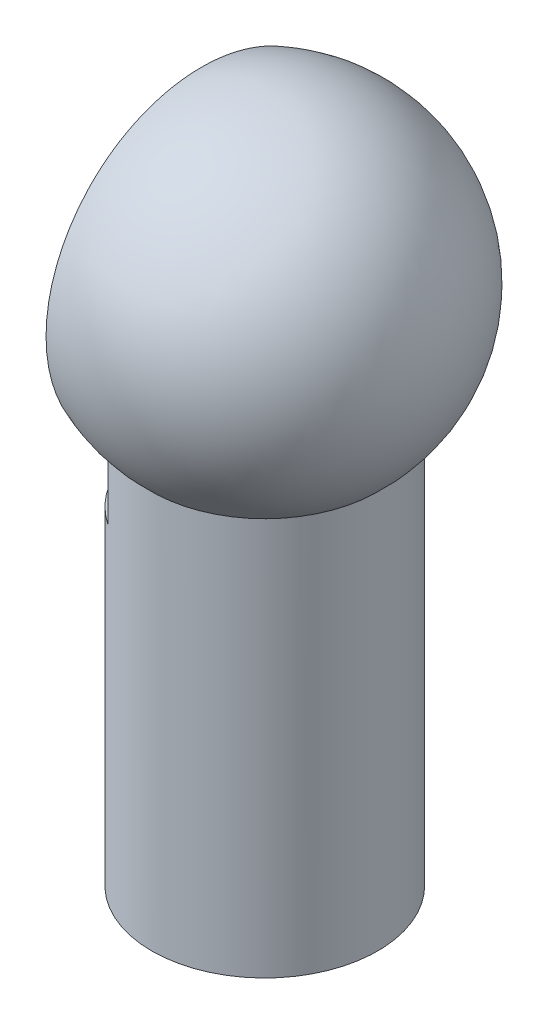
ISO-10303-21;
HEADER;
FILE_DESCRIPTION(('STEP AP214'),'2;1');
FILE_NAME('part.step','',(''),(''),'','','');
FILE_SCHEMA(('AUTOMOTIVE_DESIGN { 1 0 10303 214 1 1 1 1 }'));
ENDSEC;
DATA;
#1=APPLICATION_CONTEXT('core data for automotive mechanical design processes');
#2=APPLICATION_PROTOCOL_DEFINITION('international standard','automotive_design',2000,#1);
#3=PRODUCT_CONTEXT('',#1,'mechanical');
#4=PRODUCT('Part','Part','',(#3));
#5=PRODUCT_RELATED_PRODUCT_CATEGORY('part','',(#4));
#6=PRODUCT_DEFINITION_FORMATION('','',#4);
#7=PRODUCT_DEFINITION_CONTEXT('part definition',#1,'design');
#8=PRODUCT_DEFINITION('design','',#6,#7);
#9=PRODUCT_DEFINITION_SHAPE('','',#8);
#10=(LENGTH_UNIT() NAMED_UNIT(*) SI_UNIT(.MILLI.,.METRE.));
#11=(NAMED_UNIT(*) PLANE_ANGLE_UNIT() SI_UNIT($,.RADIAN.));
#12=(NAMED_UNIT(*) SI_UNIT($,.STERADIAN.) SOLID_ANGLE_UNIT());
#13=UNCERTAINTY_MEASURE_WITH_UNIT(LENGTH_MEASURE(1.E-05),#10,'distance_accuracy_value','');
#14=(GEOMETRIC_REPRESENTATION_CONTEXT(3) GLOBAL_UNCERTAINTY_ASSIGNED_CONTEXT((#13)) GLOBAL_UNIT_ASSIGNED_CONTEXT((#10,
#11,#12)) REPRESENTATION_CONTEXT('',''));
#15=CARTESIAN_POINT('',(0.,0.,0.));
#16=DIRECTION('',(0.,0.,1.));
#17=DIRECTION('',(1.,0.,0.));
#18=AXIS2_PLACEMENT_3D('',#15,#16,#17);
#19=CARTESIAN_POINT('',(0.,0.,0.));
#20=DIRECTION('',(0.,-1.,0.));
#21=DIRECTION('',(-1.,0.,0.));
#22=AXIS2_PLACEMENT_3D('',#19,#20,#21);
#23=SPHERICAL_SURFACE('',#22,9.65);
#24=CARTESIAN_POINT('',(0.,-7.13249605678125,0.));
#25=DIRECTION('',(0.,-1.,0.));
#26=DIRECTION('',(0.,0.,-1.));
#27=AXIS2_PLACEMENT_3D('',#24,#25,#26);
#28=CIRCLE('',#27,6.5);
#29=CARTESIAN_POINT('',(-3.63664667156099,-7.13249605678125,-5.38746702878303));
#30=VERTEX_POINT('',#29);
#31=CARTESIAN_POINT('',(-3.63664667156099,-7.13249605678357,5.38746702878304));
#32=VERTEX_POINT('',#31);
#33=EDGE_CURVE('E79',#30,#32,#28,.T.);
#34=ORIENTED_EDGE('',*,*,#33,.F.);
#35=CARTESIAN_POINT('',(-3.63664667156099,0.,0.));
#36=DIRECTION('',(1.,0.,0.));
#37=DIRECTION('',(0.,0.,-1.));
#38=AXIS2_PLACEMENT_3D('',#35,#36,#37);
#39=CIRCLE('',#38,8.9385290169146);
#40=EDGE_CURVE('E83',#30,#32,#39,.T.);
#41=ORIENTED_EDGE('',*,*,#40,.T.);
#42=EDGE_LOOP('',(#34,#41));
#43=FACE_BOUND('',#42,.T.);
#44=ADVANCED_FACE('F45',(#43),#23,.T.);
#45=CARTESIAN_POINT('',(0.,-9.99999999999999,0.));
#46=DIRECTION('',(0.,1.,0.));
#47=DIRECTION('',(0.,0.,1.));
#48=AXIS2_PLACEMENT_3D('',#45,#46,#47);
#49=PLANE('',#48);
#50=CARTESIAN_POINT('',(0.,-9.99999999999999,0.));
#51=DIRECTION('',(0.,-1.,0.));
#52=DIRECTION('',(0.,0.,-1.));
#53=AXIS2_PLACEMENT_3D('',#50,#51,#52);
#54=CIRCLE('',#53,4.);
#55=CARTESIAN_POINT('',(0.,-9.99999999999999,-4.));
#56=VERTEX_POINT('',#55);
#57=EDGE_CURVE('E97',#56,#56,#54,.T.);
#58=ORIENTED_EDGE('',*,*,#57,.T.);
#59=EDGE_LOOP('',(#58));
#60=FACE_BOUND('',#59,.T.);
#61=ADVANCED_FACE('F110',(#60),#49,.F.);
#62=CARTESIAN_POINT('',(0.,-30.,0.));
#63=DIRECTION('',(0.,-1.,0.));
#64=DIRECTION('',(0.,0.,-1.));
#65=AXIS2_PLACEMENT_3D('',#62,#63,#64);
#66=CYLINDRICAL_SURFACE('',#65,4.);
#67=ORIENTED_EDGE('',*,*,#57,.F.);
#68=EDGE_LOOP('',(#67));
#69=FACE_BOUND('',#68,.T.);
#70=CARTESIAN_POINT('',(0.,-30.,0.));
#71=DIRECTION('',(0.,-1.,0.));
#72=DIRECTION('',(0.,0.,-1.));
#73=AXIS2_PLACEMENT_3D('',#70,#71,#72);
#74=CIRCLE('',#73,4.);
#75=CARTESIAN_POINT('',(0.,-30.,-4.));
#76=VERTEX_POINT('',#75);
#77=EDGE_CURVE('E91',#76,#76,#74,.T.);
#78=ORIENTED_EDGE('',*,*,#77,.T.);
#79=EDGE_LOOP('',(#78));
#80=FACE_BOUND('',#79,.T.);
#81=ADVANCED_FACE('F116',(#69,#80),#66,.F.);
#82=CARTESIAN_POINT('',(0.,-30.,0.));
#83=DIRECTION('',(0.,1.,0.));
#84=DIRECTION('',(0.,0.,1.));
#85=AXIS2_PLACEMENT_3D('',#82,#83,#84);
#86=PLANE('',#85);
#87=ORIENTED_EDGE('',*,*,#77,.F.);
#88=EDGE_LOOP('',(#87));
#89=FACE_BOUND('',#88,.T.);
#90=CARTESIAN_POINT('',(0.,-30.,0.));
#91=DIRECTION('',(0.,-1.,0.));
#92=DIRECTION('',(0.,0.,-1.));
#93=AXIS2_PLACEMENT_3D('',#90,#91,#92);
#94=CIRCLE('',#93,6.5);
#95=CARTESIAN_POINT('',(0.,-30.,-6.5));
#96=VERTEX_POINT('',#95);
#97=EDGE_CURVE('E88',#96,#96,#94,.T.);
#98=ORIENTED_EDGE('',*,*,#97,.T.);
#99=EDGE_LOOP('',(#98));
#100=FACE_BOUND('',#99,.T.);
#101=ADVANCED_FACE('F122',(#89,#100),#86,.F.);
#102=CARTESIAN_POINT('',(0.,-30.,0.));
#103=DIRECTION('',(0.,-1.,0.));
#104=DIRECTION('',(0.,0.,-1.));
#105=AXIS2_PLACEMENT_3D('',#102,#103,#104);
#106=CYLINDRICAL_SURFACE('',#105,6.5);
#107=ORIENTED_EDGE('',*,*,#97,.F.);
#108=EDGE_LOOP('',(#107));
#109=FACE_BOUND('',#108,.T.);
#110=CARTESIAN_POINT('',(0.,-11.1324960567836,0.));
#111=DIRECTION('',(0.,-1.,0.));
#112=DIRECTION('',(0.,0.,-1.));
#113=AXIS2_PLACEMENT_3D('',#110,#111,#112);
#114=CIRCLE('',#113,6.5);
#115=CARTESIAN_POINT('',(-3.63664667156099,-11.1324960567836,5.38746702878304));
#116=VERTEX_POINT('',#115);
#117=CARTESIAN_POINT('',(-3.63664667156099,-11.1324960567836,-5.38746702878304));
#118=VERTEX_POINT('',#117);
#119=EDGE_CURVE('E82',#116,#118,#114,.T.);
#120=ORIENTED_EDGE('',*,*,#119,.T.);
#121=DIRECTION('',(0.,-1.,0.));
#122=VECTOR('',#121,1.);
#123=CARTESIAN_POINT('',(-3.63664667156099,-11.1324960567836,-5.38746702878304));
#124=LINE('',#123,#122);
#125=EDGE_CURVE('E61',#118,#30,#124,.F.);
#126=ORIENTED_EDGE('',*,*,#125,.T.);
#127=ORIENTED_EDGE('',*,*,#33,.T.);
#128=DIRECTION('',(0.,-1.,0.));
#129=VECTOR('',#128,1.);
#130=CARTESIAN_POINT('',(-3.63664667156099,-7.13249605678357,5.38746702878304));
#131=LINE('',#130,#129);
#132=EDGE_CURVE('E66',#32,#116,#131,.T.);
#133=ORIENTED_EDGE('',*,*,#132,.T.);
#134=EDGE_LOOP('',(#120,#126,#127,#133));
#135=FACE_BOUND('',#134,.T.);
#136=ADVANCED_FACE('F77',(#109,#135),#106,.T.);
#137=CARTESIAN_POINT('',(-3.63664667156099,0.,0.));
#138=DIRECTION('',(1.,0.,0.));
#139=DIRECTION('',(0.,0.,-1.));
#140=AXIS2_PLACEMENT_3D('',#137,#138,#139);
#141=PLANE('',#140);
#142=CARTESIAN_POINT('',(-3.63664667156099,0.,0.));
#143=DIRECTION('',(1.,0.,0.));
#144=DIRECTION('',(0.,0.,-1.));
#145=AXIS2_PLACEMENT_3D('',#142,#143,#144);
#146=CIRCLE('',#145,5.38746702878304);
#147=CARTESIAN_POINT('',(-3.63664667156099,0.,-5.38746702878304));
#148=VERTEX_POINT('',#147);
#149=EDGE_CURVE('E86',#148,#148,#146,.T.);
#150=ORIENTED_EDGE('',*,*,#149,.T.);
#151=EDGE_LOOP('',(#150));
#152=FACE_BOUND('',#151,.T.);
#153=ORIENTED_EDGE('',*,*,#125,.F.);
#154=CARTESIAN_POINT('',(-3.63664667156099,-11.1324960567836,-5.38746702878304));
#155=CARTESIAN_POINT('',(-3.63664667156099,-11.0509689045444,-5.28909822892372));
#156=CARTESIAN_POINT('',(-3.63664667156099,-10.9698494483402,-5.19039073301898));
#157=CARTESIAN_POINT('',(-3.63664667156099,-10.8085667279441,-4.99219173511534));
#158=CARTESIAN_POINT('',(-3.63664667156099,-10.7284035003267,-4.89270020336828));
#159=CARTESIAN_POINT('',(-3.63664667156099,-10.4893429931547,-4.59261763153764));
#160=CARTESIAN_POINT('',(-3.63664667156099,-10.3321068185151,-4.39069687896));
#161=CARTESIAN_POINT('',(-3.63664667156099,-10.0200367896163,-3.97734628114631));
#162=CARTESIAN_POINT('',(-3.63664667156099,-9.86534967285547,-3.76580450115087));
#163=CARTESIAN_POINT('',(-3.63664667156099,-9.64031603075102,-3.44367650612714));
#164=CARTESIAN_POINT('',(-3.63664667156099,-9.56648780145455,-3.33552438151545));
#165=CARTESIAN_POINT('',(-3.63664667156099,-9.42168111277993,-3.11733320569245));
#166=CARTESIAN_POINT('',(-3.63664667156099,-9.35070246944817,-3.00729427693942));
#167=CARTESIAN_POINT('',(-3.63664667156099,-9.19797003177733,-2.76212951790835));
#168=CARTESIAN_POINT('',(-3.63664667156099,-9.11700915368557,-2.62650599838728));
#169=CARTESIAN_POINT('',(-3.63664667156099,-8.9617054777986,-2.35153664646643));
#170=CARTESIAN_POINT('',(-3.63664667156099,-8.88736084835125,-2.21219185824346));
#171=CARTESIAN_POINT('',(-3.63664667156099,-8.74767442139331,-1.92988814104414));
#172=CARTESIAN_POINT('',(-3.63664667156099,-8.68228923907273,-1.7869509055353));
#173=CARTESIAN_POINT('',(-3.63664667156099,-8.56276948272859,-1.4964417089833));
#174=CARTESIAN_POINT('',(-3.63664667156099,-8.50862822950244,-1.3488725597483));
#175=CARTESIAN_POINT('',(-3.63664667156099,-8.43131488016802,-1.10196236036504));
#176=CARTESIAN_POINT('',(-3.63664667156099,-8.40395056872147,-1.00393417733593));
#177=CARTESIAN_POINT('',(-3.63664667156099,-8.35619978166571,-0.806204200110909));
#178=CARTESIAN_POINT('',(-3.63664667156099,-8.33581096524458,-0.706502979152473));
#179=CARTESIAN_POINT('',(-3.63664667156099,-8.30285070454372,-0.50601784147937));
#180=CARTESIAN_POINT('',(-3.63664667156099,-8.2902628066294,-0.405236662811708));
#181=CARTESIAN_POINT('',(-3.63664667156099,-8.27340819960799,-0.202971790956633));
#182=CARTESIAN_POINT('',(-3.63664667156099,-8.26914160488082,-0.101488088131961));
#183=CARTESIAN_POINT('',(-3.63664667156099,-8.26914395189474,0.110529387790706));
#184=CARTESIAN_POINT('',(-3.63664667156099,-8.27420716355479,0.221063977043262));
#185=CARTESIAN_POINT('',(-3.63664667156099,-8.29417029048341,0.441236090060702));
#186=CARTESIAN_POINT('',(-3.63664667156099,-8.30907136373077,0.550873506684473));
#187=CARTESIAN_POINT('',(-3.63664667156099,-8.34797263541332,0.768836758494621));
#188=CARTESIAN_POINT('',(-3.63664667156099,-8.37199966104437,0.877157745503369));
#189=CARTESIAN_POINT('',(-3.63664667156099,-8.4280506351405,1.09167585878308));
#190=CARTESIAN_POINT('',(-3.63664667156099,-8.46007485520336,1.19787291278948));
#191=CARTESIAN_POINT('',(-3.63664667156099,-8.57266066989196,1.53172641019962));
#192=CARTESIAN_POINT('',(-3.63664667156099,-8.6659644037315,1.75511611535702));
#193=CARTESIAN_POINT('',(-3.63664667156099,-8.82201590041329,2.0823221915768));
#194=CARTESIAN_POINT('',(-3.63664667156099,-8.87678675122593,2.19019524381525));
#195=CARTESIAN_POINT('',(-3.63664667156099,-8.99074370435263,2.40359076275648));
#196=CARTESIAN_POINT('',(-3.63664667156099,-9.04992927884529,2.50911350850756));
#197=CARTESIAN_POINT('',(-3.63664667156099,-9.23375784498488,2.82414223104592));
#198=CARTESIAN_POINT('',(-3.63664667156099,-9.36385211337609,3.03045172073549));
#199=CARTESIAN_POINT('',(-3.63664667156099,-9.6335955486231,3.43637865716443));
#200=CARTESIAN_POINT('',(-3.63664667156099,-9.77323698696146,3.6360013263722));
#201=CARTESIAN_POINT('',(-3.63664667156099,-10.0136480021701,3.96737676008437));
#202=CARTESIAN_POINT('',(-3.63664667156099,-10.1126003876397,4.10045761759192));
#203=CARTESIAN_POINT('',(-3.63664667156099,-10.3130279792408,4.3647066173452));
#204=CARTESIAN_POINT('',(-3.63664667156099,-10.4145032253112,4.49587472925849));
#205=CARTESIAN_POINT('',(-3.63664667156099,-10.6178449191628,4.75452381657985));
#206=CARTESIAN_POINT('',(-3.63664667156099,-10.7196791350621,4.8820302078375));
#207=CARTESIAN_POINT('',(-3.63664667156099,-10.9249580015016,5.13569482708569));
#208=CARTESIAN_POINT('',(-3.63664667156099,-11.0284022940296,5.26185334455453));
#209=CARTESIAN_POINT('',(-3.63664667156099,-11.1324960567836,5.38746702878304));
#210=B_SPLINE_CURVE_WITH_KNOTS('',3,(#154,#155,#156,#157,#158,#159,#160,#161,#162,#163,#164,
#165,#166,#167,#168,#169,#170,#171,#172,#173,#174,#175,#176,#177,#178,#179,#180,#181,#182,#183,
#184,#185,#186,#187,#188,#189,#190,#191,#192,#193,#194,#195,#196,#197,#198,#199,#200,#201,#202,
#203,#204,#205,#206,#207,#208,#209),.UNSPECIFIED.,.F.,.F.,(4,2,2,2,2,2,2,2,2,2,2,2,2,2,2,2,2,2,
2,2,2,2,2,2,2,2,2,4),(0.,0.38328484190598,0.766584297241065,1.53426972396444,2.32026465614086,
2.71307437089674,3.10585868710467,3.5795682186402,4.05314619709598,4.52434313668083,
4.9952593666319,5.30037290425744,5.60538395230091,5.90974946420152,6.21411915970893,
6.54560432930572,6.87712852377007,7.20963492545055,7.54215262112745,8.26631919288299,
8.62922368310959,8.9920848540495,9.72333994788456,10.4540099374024,10.9514905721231,
11.4489790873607,11.9385084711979,12.4279305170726),.UNSPECIFIED.);
#211=EDGE_CURVE('E11',#118,#116,#210,.T.);
#212=ORIENTED_EDGE('',*,*,#211,.T.);
#213=ORIENTED_EDGE('',*,*,#132,.F.);
#214=ORIENTED_EDGE('',*,*,#40,.F.);
#215=EDGE_LOOP('',(#153,#212,#213,#214));
#216=FACE_BOUND('',#215,.T.);
#217=ADVANCED_FACE('F84',(#152,#216),#141,.F.);
#218=CARTESIAN_POINT('',(0.,0.,0.));
#219=DIRECTION('',(0.,-1.,0.));
#220=DIRECTION('',(-1.,0.,0.));
#221=AXIS2_PLACEMENT_3D('',#218,#219,#220);
#222=SPHERICAL_SURFACE('',#221,6.5);
#223=CARTESIAN_POINT('',(0.,0.,0.));
#224=DIRECTION('',(1.,0.,0.));
#225=DIRECTION('',(0.,0.,-1.));
#226=AXIS2_PLACEMENT_3D('',#223,#224,#225);
#227=SPHERICAL_SURFACE('',#226,6.5);
#228=ORIENTED_EDGE('',*,*,#149,.F.);
#229=EDGE_LOOP('',(#228));
#230=FACE_BOUND('',#229,.T.);
#231=ADVANCED_FACE('F103',(#230),#227,.F.);
#232=CARTESIAN_POINT('',(0.,-11.1324960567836,0.));
#233=DIRECTION('',(0.,-1.,0.));
#234=DIRECTION('',(0.,0.,-1.));
#235=AXIS2_PLACEMENT_3D('',#232,#233,#234);
#236=CONICAL_SURFACE('',#235,6.5,0.785398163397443);
#237=ORIENTED_EDGE('',*,*,#119,.F.);
#238=ORIENTED_EDGE('',*,*,#211,.F.);
#239=EDGE_LOOP('',(#237,#238));
#240=FACE_BOUND('',#239,.T.);
#241=ADVANCED_FACE('F48',(#240),#236,.T.);
#242=CLOSED_SHELL('',(#44,#61,#81,#101,#136,#217,#231,#241));
#243=MANIFOLD_SOLID_BREP('B2',#242);
#244=ADVANCED_BREP_SHAPE_REPRESENTATION('',(#18,#243),#14);
#245=SHAPE_DEFINITION_REPRESENTATION(#9,#244);
ENDSEC;
END-ISO-10303-21;
